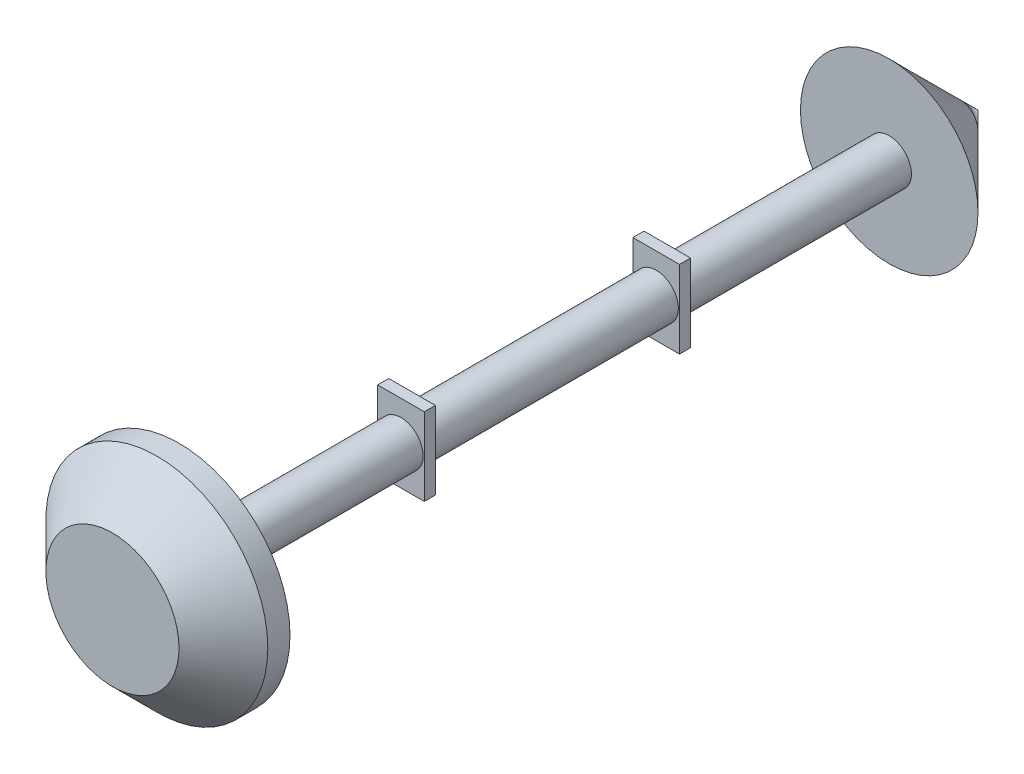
from build123d import *

# Parameters (mm, degrees)
ESQUISSE1_R      = 10
EXTRUSION1_DEPTH = 100
ESQUISSE2_W      = 21
ESQUISSE2_H      = 35
EXTRUSION2_DEPTH = 5
EXTRUSION3_START = 110
ESQUISSE3_R      = 10
EXTRUSION3_DEPTH = 110
ESQUISSE4_W      = 21
ESQUISSE4_H      = 35
EXTRUSION4_DEPTH = 5
EXTRUSION5_START = 100
ESQUISSE5_R      = 10
EXTRUSION5_DEPTH = 100
ESQUISSE7_R      = 50
EXTRUSION7_DEPTH = 30
CHANFREIN2_SIZE  = 20


with BuildPart() as part:
    # Esquisse1 → Extrusion1 (new body)
    with BuildSketch(Plane.XY):
        Circle(ESQUISSE1_R)
    extrude(amount=EXTRUSION1_DEPTH)

    # Esquisse2 → Extrusion2 (add)
    with BuildSketch(Plane(origin=(0, 0, 0), x_dir=(-1, 0, 0), z_dir=(0, 0, -1))):
        Rectangle(ESQUISSE2_W, ESQUISSE2_H)
    extrude(amount=EXTRUSION2_DEPTH)

    # Esquisse3 → Extrusion3 (add)
    with BuildSketch(Plane(origin=(0, 0, -5), x_dir=(-1, 0, 0), z_dir=(0, 0, -1)).offset(EXTRUSION3_START)):
        Circle(ESQUISSE3_R)
    extrude(amount=-EXTRUSION3_DEPTH)

    # Esquisse4 → Extrusion4 (add)
    with BuildSketch(Plane(origin=(0, 0, -115), x_dir=(-1, 0, 0), z_dir=(0, 0, -1))):
        Rectangle(ESQUISSE4_W, ESQUISSE4_H)
    extrude(amount=EXTRUSION4_DEPTH)

    # Esquisse5 → Extrusion5 (add)
    with BuildSketch(Plane(origin=(0, 0, -120), x_dir=(-1, 0, 0), z_dir=(0, 0, -1)).offset(EXTRUSION5_START)):
        Circle(ESQUISSE5_R)
    extrude(amount=-EXTRUSION5_DEPTH)

    # Esquisse7 → Extrusion7 (add)
    with BuildSketch(Plane.XY.offset(100)):
        Circle(ESQUISSE7_R)
    extrude(amount=EXTRUSION7_DEPTH)

    # Esquisse14 → R_volution1 (revolve)
    with BuildSketch(Plane(origin=(0, 0, 0), x_dir=(0, 0, -1), z_dir=(1, 0, 0)), mode=Mode.PRIVATE) as r_volution1_sk:
        Polygon((220, 0), (220, 40), (260, 0), align=None)
    revolve(r_volution1_sk.sketch.rotate(Axis((0, 0, -260), (0, 0, 1)), 90), axis=Axis((0, 0, -260), (0, 0, 1)))

    # Chanfrein2
    chanfrein2_edges = [part.edges().sort_by_distance(p)[0] for p in [
        (-50, 0, 130),
    ]]
    chamfer(chanfrein2_edges, length=CHANFREIN2_SIZE)


solid = part.part
